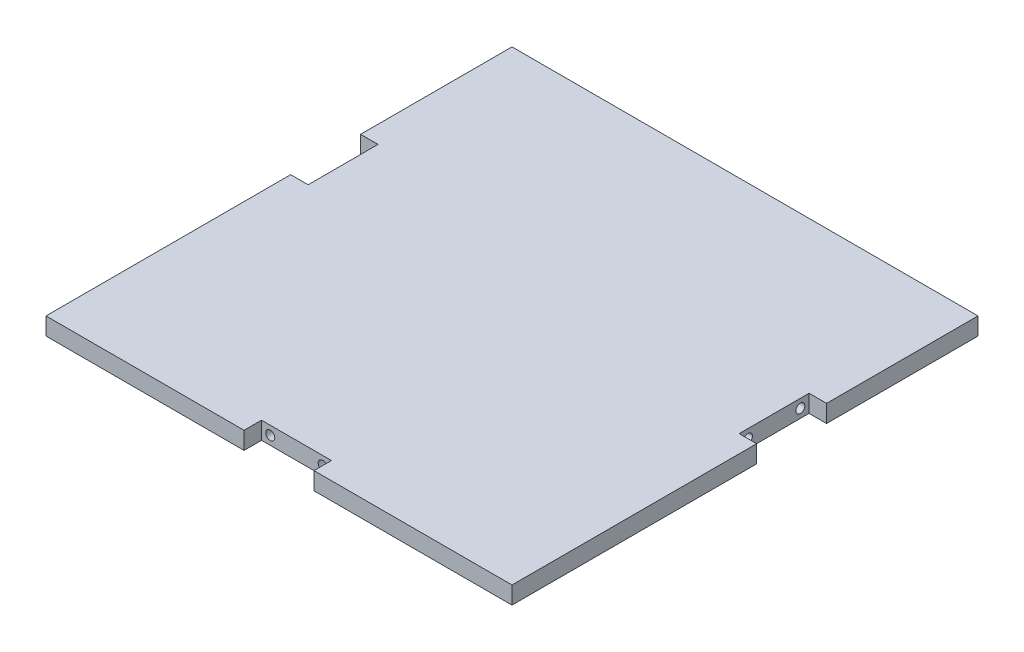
ISO-10303-21;
HEADER;
FILE_DESCRIPTION(('STEP AP214'),'2;1');
FILE_NAME('part.step','',(''),(''),'','','');
FILE_SCHEMA(('AUTOMOTIVE_DESIGN { 1 0 10303 214 1 1 1 1 }'));
ENDSEC;
DATA;
#1=APPLICATION_CONTEXT('core data for automotive mechanical design processes');
#2=APPLICATION_PROTOCOL_DEFINITION('international standard','automotive_design',2000,#1);
#3=PRODUCT_CONTEXT('',#1,'mechanical');
#4=PRODUCT('Part','Part','',(#3));
#5=PRODUCT_RELATED_PRODUCT_CATEGORY('part','',(#4));
#6=PRODUCT_DEFINITION_FORMATION('','',#4);
#7=PRODUCT_DEFINITION_CONTEXT('part definition',#1,'design');
#8=PRODUCT_DEFINITION('design','',#6,#7);
#9=PRODUCT_DEFINITION_SHAPE('','',#8);
#10=(LENGTH_UNIT() NAMED_UNIT(*) SI_UNIT(.MILLI.,.METRE.));
#11=(NAMED_UNIT(*) PLANE_ANGLE_UNIT() SI_UNIT($,.RADIAN.));
#12=(NAMED_UNIT(*) SI_UNIT($,.STERADIAN.) SOLID_ANGLE_UNIT());
#13=UNCERTAINTY_MEASURE_WITH_UNIT(LENGTH_MEASURE(1.E-05),#10,'distance_accuracy_value','');
#14=(GEOMETRIC_REPRESENTATION_CONTEXT(3) GLOBAL_UNCERTAINTY_ASSIGNED_CONTEXT((#13)) GLOBAL_UNIT_ASSIGNED_CONTEXT((#10,
#11,#12)) REPRESENTATION_CONTEXT('',''));
#15=CARTESIAN_POINT('',(0.,0.,0.));
#16=DIRECTION('',(0.,0.,1.));
#17=DIRECTION('',(1.,0.,0.));
#18=AXIS2_PLACEMENT_3D('',#15,#16,#17);
#19=CARTESIAN_POINT('',(-127.,9.525,127.));
#20=DIRECTION('',(0.,0.,-1.));
#21=DIRECTION('',(-1.,0.,0.));
#22=AXIS2_PLACEMENT_3D('',#19,#20,#21);
#23=PLANE('',#22);
#24=DIRECTION('',(1.,0.,0.));
#25=VECTOR('',#24,1.);
#26=CARTESIAN_POINT('',(-127.,0.,127.));
#27=LINE('',#26,#25);
#28=CARTESIAN_POINT('',(-127.,0.,127.));
#29=VERTEX_POINT('',#28);
#30=CARTESIAN_POINT('',(-19.05,0.,127.));
#31=VERTEX_POINT('',#30);
#32=EDGE_CURVE('E307',#29,#31,#27,.T.);
#33=ORIENTED_EDGE('',*,*,#32,.T.);
#34=DIRECTION('',(0.,1.,0.));
#35=VECTOR('',#34,1.);
#36=CARTESIAN_POINT('',(-19.05,0.,127.));
#37=LINE('',#36,#35);
#38=CARTESIAN_POINT('',(-19.05,9.525,127.));
#39=VERTEX_POINT('',#38);
#40=EDGE_CURVE('E216',#31,#39,#37,.T.);
#41=ORIENTED_EDGE('',*,*,#40,.T.);
#42=DIRECTION('',(1.,0.,0.));
#43=VECTOR('',#42,1.);
#44=CARTESIAN_POINT('',(-127.,9.525,127.));
#45=LINE('',#44,#43);
#46=CARTESIAN_POINT('',(-127.,9.525,127.));
#47=VERTEX_POINT('',#46);
#48=EDGE_CURVE('E293',#47,#39,#45,.T.);
#49=ORIENTED_EDGE('',*,*,#48,.F.);
#50=DIRECTION('',(0.,-1.,0.));
#51=VECTOR('',#50,1.);
#52=CARTESIAN_POINT('',(-127.,9.525,127.));
#53=LINE('',#52,#51);
#54=EDGE_CURVE('E312',#47,#29,#53,.T.);
#55=ORIENTED_EDGE('',*,*,#54,.T.);
#56=EDGE_LOOP('',(#33,#41,#49,#55));
#57=FACE_BOUND('',#56,.T.);
#58=ADVANCED_FACE('F33',(#57),#23,.F.);
#59=CARTESIAN_POINT('',(127.,9.525,-127.));
#60=DIRECTION('',(-1.,0.,0.));
#61=DIRECTION('',(0.,0.,1.));
#62=AXIS2_PLACEMENT_3D('',#59,#60,#61);
#63=PLANE('',#62);
#64=DIRECTION('',(0.,0.,-1.));
#65=VECTOR('',#64,1.);
#66=CARTESIAN_POINT('',(127.,9.525,-127.));
#67=LINE('',#66,#65);
#68=CARTESIAN_POINT('',(127.,9.525,-44.45));
#69=VERTEX_POINT('',#68);
#70=CARTESIAN_POINT('',(127.,9.525,-127.));
#71=VERTEX_POINT('',#70);
#72=EDGE_CURVE('E286',#69,#71,#67,.T.);
#73=ORIENTED_EDGE('',*,*,#72,.F.);
#74=DIRECTION('',(0.,1.,0.));
#75=VECTOR('',#74,1.);
#76=CARTESIAN_POINT('',(127.,0.,-44.45));
#77=LINE('',#76,#75);
#78=CARTESIAN_POINT('',(127.,0.,-44.45));
#79=VERTEX_POINT('',#78);
#80=EDGE_CURVE('E247',#79,#69,#77,.T.);
#81=ORIENTED_EDGE('',*,*,#80,.F.);
#82=DIRECTION('',(0.,0.,-1.));
#83=VECTOR('',#82,1.);
#84=CARTESIAN_POINT('',(127.,0.,-127.));
#85=LINE('',#84,#83);
#86=CARTESIAN_POINT('',(127.,0.,-127.));
#87=VERTEX_POINT('',#86);
#88=EDGE_CURVE('E276',#79,#87,#85,.T.);
#89=ORIENTED_EDGE('',*,*,#88,.T.);
#90=DIRECTION('',(0.,-1.,0.));
#91=VECTOR('',#90,1.);
#92=CARTESIAN_POINT('',(127.,9.525,-127.));
#93=LINE('',#92,#91);
#94=EDGE_CURVE('E11',#71,#87,#93,.T.);
#95=ORIENTED_EDGE('',*,*,#94,.F.);
#96=EDGE_LOOP('',(#73,#81,#89,#95));
#97=FACE_BOUND('',#96,.T.);
#98=ADVANCED_FACE('F339',(#97),#63,.F.);
#99=CARTESIAN_POINT('',(-127.,9.525,-127.));
#100=DIRECTION('',(1.,0.,0.));
#101=DIRECTION('',(0.,0.,-1.));
#102=AXIS2_PLACEMENT_3D('',#99,#100,#101);
#103=PLANE('',#102);
#104=DIRECTION('',(0.,0.,1.));
#105=VECTOR('',#104,1.);
#106=CARTESIAN_POINT('',(-127.,0.,-127.));
#107=LINE('',#106,#105);
#108=CARTESIAN_POINT('',(-127.,0.,-127.));
#109=VERTEX_POINT('',#108);
#110=CARTESIAN_POINT('',(-127.,0.,-44.45));
#111=VERTEX_POINT('',#110);
#112=EDGE_CURVE('E303',#109,#111,#107,.T.);
#113=ORIENTED_EDGE('',*,*,#112,.T.);
#114=DIRECTION('',(0.,1.,0.));
#115=VECTOR('',#114,1.);
#116=CARTESIAN_POINT('',(-127.,0.,-44.45));
#117=LINE('',#116,#115);
#118=CARTESIAN_POINT('',(-127.,9.525,-44.45));
#119=VERTEX_POINT('',#118);
#120=EDGE_CURVE('E273',#111,#119,#117,.T.);
#121=ORIENTED_EDGE('',*,*,#120,.T.);
#122=DIRECTION('',(0.,0.,1.));
#123=VECTOR('',#122,1.);
#124=CARTESIAN_POINT('',(-127.,9.525,-127.));
#125=LINE('',#124,#123);
#126=CARTESIAN_POINT('',(-127.,9.525,-127.));
#127=VERTEX_POINT('',#126);
#128=EDGE_CURVE('E289',#127,#119,#125,.T.);
#129=ORIENTED_EDGE('',*,*,#128,.F.);
#130=DIRECTION('',(0.,-1.,0.));
#131=VECTOR('',#130,1.);
#132=CARTESIAN_POINT('',(-127.,9.525,-127.));
#133=LINE('',#132,#131);
#134=EDGE_CURVE('E41',#127,#109,#133,.T.);
#135=ORIENTED_EDGE('',*,*,#134,.T.);
#136=EDGE_LOOP('',(#113,#121,#129,#135));
#137=FACE_BOUND('',#136,.T.);
#138=ADVANCED_FACE('F319',(#137),#103,.F.);
#139=CARTESIAN_POINT('',(127.,0.,127.));
#140=VERTEX_POINT('',#139);
#141=CARTESIAN_POINT('',(127.,0.,-6.34999999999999));
#142=VERTEX_POINT('',#141);
#143=EDGE_CURVE('E297',#140,#142,#85,.T.);
#144=ORIENTED_EDGE('',*,*,#143,.T.);
#145=DIRECTION('',(0.,1.,0.));
#146=VECTOR('',#145,1.);
#147=CARTESIAN_POINT('',(127.,0.,-6.34999999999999));
#148=LINE('',#147,#146);
#149=CARTESIAN_POINT('',(127.,9.525,-6.34999999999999));
#150=VERTEX_POINT('',#149);
#151=EDGE_CURVE('E250',#142,#150,#148,.T.);
#152=ORIENTED_EDGE('',*,*,#151,.T.);
#153=CARTESIAN_POINT('',(127.,9.525,127.));
#154=VERTEX_POINT('',#153);
#155=EDGE_CURVE('E282',#154,#150,#67,.T.);
#156=ORIENTED_EDGE('',*,*,#155,.F.);
#157=DIRECTION('',(0.,-1.,0.));
#158=VECTOR('',#157,1.);
#159=CARTESIAN_POINT('',(127.,9.525,127.));
#160=LINE('',#159,#158);
#161=EDGE_CURVE('E296',#154,#140,#160,.T.);
#162=ORIENTED_EDGE('',*,*,#161,.T.);
#163=EDGE_LOOP('',(#144,#152,#156,#162));
#164=FACE_BOUND('',#163,.T.);
#165=ADVANCED_FACE('F35',(#164),#63,.F.);
#166=CARTESIAN_POINT('',(-127.,9.525,-127.));
#167=DIRECTION('',(0.,0.,1.));
#168=DIRECTION('',(1.,0.,0.));
#169=AXIS2_PLACEMENT_3D('',#166,#167,#168);
#170=PLANE('',#169);
#171=DIRECTION('',(-1.,0.,0.));
#172=VECTOR('',#171,1.);
#173=CARTESIAN_POINT('',(-127.,0.,-127.));
#174=LINE('',#173,#172);
#175=EDGE_CURVE('E300',#87,#109,#174,.T.);
#176=ORIENTED_EDGE('',*,*,#175,.T.);
#177=ORIENTED_EDGE('',*,*,#134,.F.);
#178=DIRECTION('',(-1.,0.,0.));
#179=VECTOR('',#178,1.);
#180=CARTESIAN_POINT('',(-127.,9.525,-127.));
#181=LINE('',#180,#179);
#182=EDGE_CURVE('E285',#71,#127,#181,.T.);
#183=ORIENTED_EDGE('',*,*,#182,.F.);
#184=ORIENTED_EDGE('',*,*,#94,.T.);
#185=EDGE_LOOP('',(#176,#177,#183,#184));
#186=FACE_BOUND('',#185,.T.);
#187=ADVANCED_FACE('F337',(#186),#170,.F.);
#188=CARTESIAN_POINT('',(-127.,9.525,-6.34999999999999));
#189=VERTEX_POINT('',#188);
#190=EDGE_CURVE('E288',#189,#47,#125,.T.);
#191=ORIENTED_EDGE('',*,*,#190,.F.);
#192=DIRECTION('',(0.,1.,0.));
#193=VECTOR('',#192,1.);
#194=CARTESIAN_POINT('',(-127.,0.,-6.34999999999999));
#195=LINE('',#194,#193);
#196=CARTESIAN_POINT('',(-127.,0.,-6.34999999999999));
#197=VERTEX_POINT('',#196);
#198=EDGE_CURVE('E266',#197,#189,#195,.T.);
#199=ORIENTED_EDGE('',*,*,#198,.F.);
#200=EDGE_CURVE('E302',#197,#29,#107,.T.);
#201=ORIENTED_EDGE('',*,*,#200,.T.);
#202=ORIENTED_EDGE('',*,*,#54,.F.);
#203=EDGE_LOOP('',(#191,#199,#201,#202));
#204=FACE_BOUND('',#203,.T.);
#205=ADVANCED_FACE('F374',(#204),#103,.F.);
#206=CARTESIAN_POINT('',(19.05,9.525,127.));
#207=VERTEX_POINT('',#206);
#208=EDGE_CURVE('E292',#207,#154,#45,.T.);
#209=ORIENTED_EDGE('',*,*,#208,.F.);
#210=DIRECTION('',(0.,1.,0.));
#211=VECTOR('',#210,1.);
#212=CARTESIAN_POINT('',(19.05,0.,127.));
#213=LINE('',#212,#211);
#214=CARTESIAN_POINT('',(19.05,0.,127.));
#215=VERTEX_POINT('',#214);
#216=EDGE_CURVE('E228',#215,#207,#213,.T.);
#217=ORIENTED_EDGE('',*,*,#216,.F.);
#218=EDGE_CURVE('E306',#215,#140,#27,.T.);
#219=ORIENTED_EDGE('',*,*,#218,.T.);
#220=ORIENTED_EDGE('',*,*,#161,.F.);
#221=EDGE_LOOP('',(#209,#217,#219,#220));
#222=FACE_BOUND('',#221,.T.);
#223=ADVANCED_FACE('F358',(#222),#23,.F.);
#224=CARTESIAN_POINT('',(0.,9.525,0.));
#225=DIRECTION('',(0.,1.,0.));
#226=DIRECTION('',(0.,0.,1.));
#227=AXIS2_PLACEMENT_3D('',#224,#225,#226);
#228=PLANE('',#227);
#229=DIRECTION('',(0.,0.,1.));
#230=VECTOR('',#229,1.);
#231=CARTESIAN_POINT('',(-19.05,9.525,127.));
#232=LINE('',#231,#230);
#233=CARTESIAN_POINT('',(-19.05,9.525,117.475));
#234=VERTEX_POINT('',#233);
#235=EDGE_CURVE('E207',#234,#39,#232,.T.);
#236=ORIENTED_EDGE('',*,*,#235,.F.);
#237=DIRECTION('',(-1.,0.,0.));
#238=VECTOR('',#237,1.);
#239=CARTESIAN_POINT('',(-19.05,9.525,117.475));
#240=LINE('',#239,#238);
#241=CARTESIAN_POINT('',(19.05,9.525,117.475));
#242=VERTEX_POINT('',#241);
#243=EDGE_CURVE('E212',#242,#234,#240,.T.);
#244=ORIENTED_EDGE('',*,*,#243,.F.);
#245=DIRECTION('',(0.,0.,-1.));
#246=VECTOR('',#245,1.);
#247=CARTESIAN_POINT('',(19.05,9.525,127.));
#248=LINE('',#247,#246);
#249=EDGE_CURVE('E218',#207,#242,#248,.T.);
#250=ORIENTED_EDGE('',*,*,#249,.F.);
#251=ORIENTED_EDGE('',*,*,#208,.T.);
#252=ORIENTED_EDGE('',*,*,#155,.T.);
#253=DIRECTION('',(1.,0.,0.));
#254=VECTOR('',#253,1.);
#255=CARTESIAN_POINT('',(127.,9.525,-6.34999999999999));
#256=LINE('',#255,#254);
#257=CARTESIAN_POINT('',(117.475,9.525,-6.34999999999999));
#258=VERTEX_POINT('',#257);
#259=EDGE_CURVE('E236',#258,#150,#256,.T.);
#260=ORIENTED_EDGE('',*,*,#259,.F.);
#261=DIRECTION('',(0.,0.,1.));
#262=VECTOR('',#261,1.);
#263=CARTESIAN_POINT('',(117.475,9.525,-44.45));
#264=LINE('',#263,#262);
#265=CARTESIAN_POINT('',(117.475,9.525,-44.45));
#266=VERTEX_POINT('',#265);
#267=EDGE_CURVE('E243',#266,#258,#264,.T.);
#268=ORIENTED_EDGE('',*,*,#267,.F.);
#269=DIRECTION('',(-1.,0.,0.));
#270=VECTOR('',#269,1.);
#271=CARTESIAN_POINT('',(127.,9.525,-44.45));
#272=LINE('',#271,#270);
#273=EDGE_CURVE('E225',#69,#266,#272,.T.);
#274=ORIENTED_EDGE('',*,*,#273,.F.);
#275=ORIENTED_EDGE('',*,*,#72,.T.);
#276=ORIENTED_EDGE('',*,*,#182,.T.);
#277=ORIENTED_EDGE('',*,*,#128,.T.);
#278=DIRECTION('',(-1.,0.,0.));
#279=VECTOR('',#278,1.);
#280=CARTESIAN_POINT('',(-127.,9.525,-44.45));
#281=LINE('',#280,#279);
#282=CARTESIAN_POINT('',(-117.475,9.525,-44.45));
#283=VERTEX_POINT('',#282);
#284=EDGE_CURVE('E260',#283,#119,#281,.T.);
#285=ORIENTED_EDGE('',*,*,#284,.F.);
#286=DIRECTION('',(0.,0.,-1.));
#287=VECTOR('',#286,1.);
#288=CARTESIAN_POINT('',(-117.475,9.525,-44.45));
#289=LINE('',#288,#287);
#290=CARTESIAN_POINT('',(-117.475,9.525,-6.34999999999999));
#291=VERTEX_POINT('',#290);
#292=EDGE_CURVE('E269',#291,#283,#289,.T.);
#293=ORIENTED_EDGE('',*,*,#292,.F.);
#294=DIRECTION('',(1.,0.,0.));
#295=VECTOR('',#294,1.);
#296=CARTESIAN_POINT('',(-127.,9.525,-6.34999999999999));
#297=LINE('',#296,#295);
#298=EDGE_CURVE('E249',#189,#291,#297,.T.);
#299=ORIENTED_EDGE('',*,*,#298,.F.);
#300=ORIENTED_EDGE('',*,*,#190,.T.);
#301=ORIENTED_EDGE('',*,*,#48,.T.);
#302=EDGE_LOOP('',(#236,#244,#250,#251,#252,#260,#268,#274,#275,#276,#277,#285,#293,#299,#300,#301));
#303=FACE_BOUND('',#302,.T.);
#304=ADVANCED_FACE('F332',(#303),#228,.T.);
#305=CARTESIAN_POINT('',(0.,0.,0.));
#306=DIRECTION('',(0.,1.,0.));
#307=DIRECTION('',(0.,0.,1.));
#308=AXIS2_PLACEMENT_3D('',#305,#306,#307);
#309=PLANE('',#308);
#310=DIRECTION('',(-1.,0.,0.));
#311=VECTOR('',#310,1.);
#312=CARTESIAN_POINT('',(-19.05,0.,117.475));
#313=LINE('',#312,#311);
#314=CARTESIAN_POINT('',(19.05,0.,117.475));
#315=VERTEX_POINT('',#314);
#316=CARTESIAN_POINT('',(-19.05,0.,117.475));
#317=VERTEX_POINT('',#316);
#318=EDGE_CURVE('E48',#315,#317,#313,.T.);
#319=ORIENTED_EDGE('',*,*,#318,.T.);
#320=DIRECTION('',(0.,0.,1.));
#321=VECTOR('',#320,1.);
#322=CARTESIAN_POINT('',(-19.05,0.,127.));
#323=LINE('',#322,#321);
#324=EDGE_CURVE('E208',#317,#31,#323,.T.);
#325=ORIENTED_EDGE('',*,*,#324,.T.);
#326=ORIENTED_EDGE('',*,*,#32,.F.);
#327=ORIENTED_EDGE('',*,*,#200,.F.);
#328=DIRECTION('',(1.,0.,0.));
#329=VECTOR('',#328,1.);
#330=CARTESIAN_POINT('',(-127.,0.,-6.34999999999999));
#331=LINE('',#330,#329);
#332=CARTESIAN_POINT('',(-117.475,0.,-6.34999999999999));
#333=VERTEX_POINT('',#332);
#334=EDGE_CURVE('E256',#197,#333,#331,.T.);
#335=ORIENTED_EDGE('',*,*,#334,.T.);
#336=DIRECTION('',(0.,0.,-1.));
#337=VECTOR('',#336,1.);
#338=CARTESIAN_POINT('',(-117.475,0.,-44.45));
#339=LINE('',#338,#337);
#340=CARTESIAN_POINT('',(-117.475,0.,-44.45));
#341=VERTEX_POINT('',#340);
#342=EDGE_CURVE('E259',#333,#341,#339,.T.);
#343=ORIENTED_EDGE('',*,*,#342,.T.);
#344=DIRECTION('',(-1.,0.,0.));
#345=VECTOR('',#344,1.);
#346=CARTESIAN_POINT('',(-127.,0.,-44.45));
#347=LINE('',#346,#345);
#348=EDGE_CURVE('E263',#341,#111,#347,.T.);
#349=ORIENTED_EDGE('',*,*,#348,.T.);
#350=ORIENTED_EDGE('',*,*,#112,.F.);
#351=ORIENTED_EDGE('',*,*,#175,.F.);
#352=ORIENTED_EDGE('',*,*,#88,.F.);
#353=DIRECTION('',(-1.,0.,0.));
#354=VECTOR('',#353,1.);
#355=CARTESIAN_POINT('',(127.,0.,-44.45));
#356=LINE('',#355,#354);
#357=CARTESIAN_POINT('',(117.475,0.,-44.45));
#358=VERTEX_POINT('',#357);
#359=EDGE_CURVE('E232',#79,#358,#356,.T.);
#360=ORIENTED_EDGE('',*,*,#359,.T.);
#361=DIRECTION('',(0.,0.,1.));
#362=VECTOR('',#361,1.);
#363=CARTESIAN_POINT('',(117.475,0.,-44.45));
#364=LINE('',#363,#362);
#365=CARTESIAN_POINT('',(117.475,0.,-6.34999999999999));
#366=VERTEX_POINT('',#365);
#367=EDGE_CURVE('E235',#358,#366,#364,.T.);
#368=ORIENTED_EDGE('',*,*,#367,.T.);
#369=DIRECTION('',(1.,0.,0.));
#370=VECTOR('',#369,1.);
#371=CARTESIAN_POINT('',(127.,0.,-6.34999999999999));
#372=LINE('',#371,#370);
#373=EDGE_CURVE('E56',#366,#142,#372,.T.);
#374=ORIENTED_EDGE('',*,*,#373,.T.);
#375=ORIENTED_EDGE('',*,*,#143,.F.);
#376=ORIENTED_EDGE('',*,*,#218,.F.);
#377=DIRECTION('',(0.,0.,-1.));
#378=VECTOR('',#377,1.);
#379=CARTESIAN_POINT('',(19.05,0.,127.));
#380=LINE('',#379,#378);
#381=EDGE_CURVE('E211',#215,#315,#380,.T.);
#382=ORIENTED_EDGE('',*,*,#381,.T.);
#383=EDGE_LOOP('',(#319,#325,#326,#327,#335,#343,#349,#350,#351,#352,#360,#368,#374,#375,#376,#382));
#384=FACE_BOUND('',#383,.T.);
#385=ADVANCED_FACE('F324',(#384),#309,.F.);
#386=CARTESIAN_POINT('',(-127.,0.,-44.45));
#387=DIRECTION('',(0.,0.,-1.));
#388=DIRECTION('',(-1.,0.,0.));
#389=AXIS2_PLACEMENT_3D('',#386,#387,#388);
#390=PLANE('',#389);
#391=ORIENTED_EDGE('',*,*,#284,.T.);
#392=ORIENTED_EDGE('',*,*,#120,.F.);
#393=ORIENTED_EDGE('',*,*,#348,.F.);
#394=DIRECTION('',(0.,1.,0.));
#395=VECTOR('',#394,1.);
#396=CARTESIAN_POINT('',(-117.475,0.,-44.45));
#397=LINE('',#396,#395);
#398=EDGE_CURVE('E277',#341,#283,#397,.T.);
#399=ORIENTED_EDGE('',*,*,#398,.T.);
#400=EDGE_LOOP('',(#391,#392,#393,#399));
#401=FACE_BOUND('',#400,.T.);
#402=ADVANCED_FACE('F328',(#401),#390,.F.);
#403=CARTESIAN_POINT('',(-117.475,0.,-44.45));
#404=DIRECTION('',(1.,0.,0.));
#405=DIRECTION('',(0.,0.,-1.));
#406=AXIS2_PLACEMENT_3D('',#403,#404,#405);
#407=PLANE('',#406);
#408=CARTESIAN_POINT('',(-117.475,4.7625,-39.6875));
#409=DIRECTION('',(-1.,0.,0.));
#410=DIRECTION('',(0.,0.,1.));
#411=AXIS2_PLACEMENT_3D('',#408,#409,#410);
#412=CIRCLE('',#411,2.45744999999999);
#413=CARTESIAN_POINT('',(-117.475,4.7625,-37.23005));
#414=VERTEX_POINT('',#413);
#415=EDGE_CURVE('E173',#414,#414,#412,.T.);
#416=ORIENTED_EDGE('',*,*,#415,.F.);
#417=EDGE_LOOP('',(#416));
#418=FACE_BOUND('',#417,.T.);
#419=CARTESIAN_POINT('',(-117.475,4.7625,-11.1125));
#420=DIRECTION('',(-1.,0.,0.));
#421=DIRECTION('',(0.,0.,1.));
#422=AXIS2_PLACEMENT_3D('',#419,#420,#421);
#423=CIRCLE('',#422,2.45744999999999);
#424=CARTESIAN_POINT('',(-117.475,4.7625,-8.65505));
#425=VERTEX_POINT('',#424);
#426=EDGE_CURVE('E172',#425,#425,#423,.T.);
#427=ORIENTED_EDGE('',*,*,#426,.F.);
#428=EDGE_LOOP('',(#427));
#429=FACE_BOUND('',#428,.T.);
#430=ORIENTED_EDGE('',*,*,#292,.T.);
#431=ORIENTED_EDGE('',*,*,#398,.F.);
#432=ORIENTED_EDGE('',*,*,#342,.F.);
#433=DIRECTION('',(0.,1.,0.));
#434=VECTOR('',#433,1.);
#435=CARTESIAN_POINT('',(-117.475,0.,-6.34999999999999));
#436=LINE('',#435,#434);
#437=EDGE_CURVE('E279',#333,#291,#436,.T.);
#438=ORIENTED_EDGE('',*,*,#437,.T.);
#439=EDGE_LOOP('',(#430,#431,#432,#438));
#440=FACE_BOUND('',#439,.T.);
#441=ADVANCED_FACE('F380',(#418,#429,#440),#407,.F.);
#442=CARTESIAN_POINT('',(-127.,0.,-6.34999999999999));
#443=DIRECTION('',(0.,0.,1.));
#444=DIRECTION('',(1.,0.,0.));
#445=AXIS2_PLACEMENT_3D('',#442,#443,#444);
#446=PLANE('',#445);
#447=ORIENTED_EDGE('',*,*,#298,.T.);
#448=ORIENTED_EDGE('',*,*,#437,.F.);
#449=ORIENTED_EDGE('',*,*,#334,.F.);
#450=ORIENTED_EDGE('',*,*,#198,.T.);
#451=EDGE_LOOP('',(#447,#448,#449,#450));
#452=FACE_BOUND('',#451,.T.);
#453=ADVANCED_FACE('F377',(#452),#446,.F.);
#454=CARTESIAN_POINT('',(127.,0.,-44.45));
#455=DIRECTION('',(0.,0.,-1.));
#456=DIRECTION('',(-1.,0.,0.));
#457=AXIS2_PLACEMENT_3D('',#454,#455,#456);
#458=PLANE('',#457);
#459=ORIENTED_EDGE('',*,*,#273,.T.);
#460=DIRECTION('',(0.,1.,0.));
#461=VECTOR('',#460,1.);
#462=CARTESIAN_POINT('',(117.475,0.,-44.45));
#463=LINE('',#462,#461);
#464=EDGE_CURVE('E240',#358,#266,#463,.T.);
#465=ORIENTED_EDGE('',*,*,#464,.F.);
#466=ORIENTED_EDGE('',*,*,#359,.F.);
#467=ORIENTED_EDGE('',*,*,#80,.T.);
#468=EDGE_LOOP('',(#459,#465,#466,#467));
#469=FACE_BOUND('',#468,.T.);
#470=ADVANCED_FACE('F343',(#469),#458,.F.);
#471=CARTESIAN_POINT('',(127.,0.,-6.34999999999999));
#472=DIRECTION('',(0.,0.,1.));
#473=DIRECTION('',(1.,0.,0.));
#474=AXIS2_PLACEMENT_3D('',#471,#472,#473);
#475=PLANE('',#474);
#476=ORIENTED_EDGE('',*,*,#259,.T.);
#477=ORIENTED_EDGE('',*,*,#151,.F.);
#478=ORIENTED_EDGE('',*,*,#373,.F.);
#479=DIRECTION('',(0.,1.,0.));
#480=VECTOR('',#479,1.);
#481=CARTESIAN_POINT('',(117.475,0.,-6.34999999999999));
#482=LINE('',#481,#480);
#483=EDGE_CURVE('E253',#366,#258,#482,.T.);
#484=ORIENTED_EDGE('',*,*,#483,.T.);
#485=EDGE_LOOP('',(#476,#477,#478,#484));
#486=FACE_BOUND('',#485,.T.);
#487=ADVANCED_FACE('F348',(#486),#475,.F.);
#488=CARTESIAN_POINT('',(117.475,0.,-44.45));
#489=DIRECTION('',(-1.,0.,0.));
#490=DIRECTION('',(0.,0.,1.));
#491=AXIS2_PLACEMENT_3D('',#488,#489,#490);
#492=PLANE('',#491);
#493=CARTESIAN_POINT('',(117.475,4.7625,-11.1125));
#494=DIRECTION('',(1.,0.,0.));
#495=DIRECTION('',(0.,0.,-1.));
#496=AXIS2_PLACEMENT_3D('',#493,#494,#495);
#497=CIRCLE('',#496,2.45744999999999);
#498=CARTESIAN_POINT('',(117.475,4.7625,-13.56995));
#499=VERTEX_POINT('',#498);
#500=EDGE_CURVE('E195',#499,#499,#497,.T.);
#501=ORIENTED_EDGE('',*,*,#500,.F.);
#502=EDGE_LOOP('',(#501));
#503=FACE_BOUND('',#502,.T.);
#504=CARTESIAN_POINT('',(117.475,4.7625,-39.6875));
#505=DIRECTION('',(1.,0.,0.));
#506=DIRECTION('',(0.,0.,-1.));
#507=AXIS2_PLACEMENT_3D('',#504,#505,#506);
#508=CIRCLE('',#507,2.45744999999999);
#509=CARTESIAN_POINT('',(117.475,4.7625,-42.14495));
#510=VERTEX_POINT('',#509);
#511=EDGE_CURVE('E201',#510,#510,#508,.T.);
#512=ORIENTED_EDGE('',*,*,#511,.F.);
#513=EDGE_LOOP('',(#512));
#514=FACE_BOUND('',#513,.T.);
#515=ORIENTED_EDGE('',*,*,#267,.T.);
#516=ORIENTED_EDGE('',*,*,#483,.F.);
#517=ORIENTED_EDGE('',*,*,#367,.F.);
#518=ORIENTED_EDGE('',*,*,#464,.T.);
#519=EDGE_LOOP('',(#515,#516,#517,#518));
#520=FACE_BOUND('',#519,.T.);
#521=ADVANCED_FACE('F346',(#503,#514,#520),#492,.F.);
#522=CARTESIAN_POINT('',(-19.05,0.,127.));
#523=DIRECTION('',(-1.,0.,0.));
#524=DIRECTION('',(0.,0.,1.));
#525=AXIS2_PLACEMENT_3D('',#522,#523,#524);
#526=PLANE('',#525);
#527=ORIENTED_EDGE('',*,*,#235,.T.);
#528=ORIENTED_EDGE('',*,*,#40,.F.);
#529=ORIENTED_EDGE('',*,*,#324,.F.);
#530=DIRECTION('',(0.,1.,0.));
#531=VECTOR('',#530,1.);
#532=CARTESIAN_POINT('',(-19.05,0.,117.475));
#533=LINE('',#532,#531);
#534=EDGE_CURVE('E223',#317,#234,#533,.T.);
#535=ORIENTED_EDGE('',*,*,#534,.T.);
#536=EDGE_LOOP('',(#527,#528,#529,#535));
#537=FACE_BOUND('',#536,.T.);
#538=ADVANCED_FACE('F366',(#537),#526,.F.);
#539=CARTESIAN_POINT('',(-19.05,0.,117.475));
#540=DIRECTION('',(0.,0.,-1.));
#541=DIRECTION('',(-1.,0.,0.));
#542=AXIS2_PLACEMENT_3D('',#539,#540,#541);
#543=PLANE('',#542);
#544=CARTESIAN_POINT('',(-14.2875,4.7625,117.475));
#545=DIRECTION('',(0.,0.,1.));
#546=DIRECTION('',(1.,0.,0.));
#547=AXIS2_PLACEMENT_3D('',#544,#545,#546);
#548=CIRCLE('',#547,2.45744999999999);
#549=CARTESIAN_POINT('',(-11.83005,4.7625,117.475));
#550=VERTEX_POINT('',#549);
#551=EDGE_CURVE('E183',#550,#550,#548,.T.);
#552=ORIENTED_EDGE('',*,*,#551,.F.);
#553=EDGE_LOOP('',(#552));
#554=FACE_BOUND('',#553,.T.);
#555=CARTESIAN_POINT('',(14.2875,4.7625,117.475));
#556=DIRECTION('',(0.,0.,1.));
#557=DIRECTION('',(1.,0.,0.));
#558=AXIS2_PLACEMENT_3D('',#555,#556,#557);
#559=CIRCLE('',#558,2.45744999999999);
#560=CARTESIAN_POINT('',(16.74495,4.7625,117.475));
#561=VERTEX_POINT('',#560);
#562=EDGE_CURVE('E189',#561,#561,#559,.T.);
#563=ORIENTED_EDGE('',*,*,#562,.F.);
#564=EDGE_LOOP('',(#563));
#565=FACE_BOUND('',#564,.T.);
#566=ORIENTED_EDGE('',*,*,#243,.T.);
#567=ORIENTED_EDGE('',*,*,#534,.F.);
#568=ORIENTED_EDGE('',*,*,#318,.F.);
#569=DIRECTION('',(0.,1.,0.));
#570=VECTOR('',#569,1.);
#571=CARTESIAN_POINT('',(19.05,0.,117.475));
#572=LINE('',#571,#570);
#573=EDGE_CURVE('E226',#315,#242,#572,.T.);
#574=ORIENTED_EDGE('',*,*,#573,.T.);
#575=EDGE_LOOP('',(#566,#567,#568,#574));
#576=FACE_BOUND('',#575,.T.);
#577=ADVANCED_FACE('F362',(#554,#565,#576),#543,.F.);
#578=CARTESIAN_POINT('',(19.05,0.,127.));
#579=DIRECTION('',(1.,0.,0.));
#580=DIRECTION('',(0.,0.,-1.));
#581=AXIS2_PLACEMENT_3D('',#578,#579,#580);
#582=PLANE('',#581);
#583=ORIENTED_EDGE('',*,*,#249,.T.);
#584=ORIENTED_EDGE('',*,*,#573,.F.);
#585=ORIENTED_EDGE('',*,*,#381,.F.);
#586=ORIENTED_EDGE('',*,*,#216,.T.);
#587=EDGE_LOOP('',(#583,#584,#585,#586));
#588=FACE_BOUND('',#587,.T.);
#589=ADVANCED_FACE('F361',(#588),#582,.F.);
#590=CARTESIAN_POINT('',(104.775,4.7625,-39.6875));
#591=DIRECTION('',(1.,0.,0.));
#592=DIRECTION('',(0.,0.,-1.));
#593=AXIS2_PLACEMENT_3D('',#590,#591,#592);
#594=CONICAL_SURFACE('',#593,2.45745,1.02974425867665);
#595=CARTESIAN_POINT('',(103.298415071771,4.76249999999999,-39.6875));
#596=VERTEX_POINT('',#595);
#597=VERTEX_LOOP('',#596);
#598=FACE_BOUND('',#597,.T.);
#599=CARTESIAN_POINT('',(104.775,4.7625,-39.6875));
#600=DIRECTION('',(1.,0.,0.));
#601=DIRECTION('',(0.,0.,-1.));
#602=AXIS2_PLACEMENT_3D('',#599,#600,#601);
#603=CIRCLE('',#602,2.45745);
#604=CARTESIAN_POINT('',(104.775,4.7625,-42.14495));
#605=VERTEX_POINT('',#604);
#606=EDGE_CURVE('E204',#605,#605,#603,.T.);
#607=ORIENTED_EDGE('',*,*,#606,.T.);
#608=EDGE_LOOP('',(#607));
#609=FACE_BOUND('',#608,.T.);
#610=ADVANCED_FACE('F503',(#598,#609),#594,.F.);
#611=CARTESIAN_POINT('',(117.475,4.7625,-39.6875));
#612=DIRECTION('',(1.,0.,0.));
#613=DIRECTION('',(0.,0.,-1.));
#614=AXIS2_PLACEMENT_3D('',#611,#612,#613);
#615=CYLINDRICAL_SURFACE('',#614,2.45744999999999);
#616=ORIENTED_EDGE('',*,*,#606,.F.);
#617=EDGE_LOOP('',(#616));
#618=FACE_BOUND('',#617,.T.);
#619=ORIENTED_EDGE('',*,*,#511,.T.);
#620=EDGE_LOOP('',(#619));
#621=FACE_BOUND('',#620,.T.);
#622=ADVANCED_FACE('F519',(#618,#621),#615,.F.);
#623=CARTESIAN_POINT('',(104.775,4.7625,-11.1125));
#624=DIRECTION('',(1.,0.,0.));
#625=DIRECTION('',(0.,0.,-1.));
#626=AXIS2_PLACEMENT_3D('',#623,#624,#625);
#627=CONICAL_SURFACE('',#626,2.45745,1.02974425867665);
#628=CARTESIAN_POINT('',(103.298415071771,4.7625,-11.1125));
#629=VERTEX_POINT('',#628);
#630=VERTEX_LOOP('',#629);
#631=FACE_BOUND('',#630,.T.);
#632=CARTESIAN_POINT('',(104.775,4.7625,-11.1125));
#633=DIRECTION('',(1.,0.,0.));
#634=DIRECTION('',(0.,0.,-1.));
#635=AXIS2_PLACEMENT_3D('',#632,#633,#634);
#636=CIRCLE('',#635,2.45745);
#637=CARTESIAN_POINT('',(104.775,4.7625,-13.56995));
#638=VERTEX_POINT('',#637);
#639=EDGE_CURVE('E198',#638,#638,#636,.T.);
#640=ORIENTED_EDGE('',*,*,#639,.T.);
#641=EDGE_LOOP('',(#640));
#642=FACE_BOUND('',#641,.T.);
#643=ADVANCED_FACE('F529',(#631,#642),#627,.F.);
#644=CARTESIAN_POINT('',(117.475,4.7625,-11.1125));
#645=DIRECTION('',(1.,0.,0.));
#646=DIRECTION('',(0.,0.,-1.));
#647=AXIS2_PLACEMENT_3D('',#644,#645,#646);
#648=CYLINDRICAL_SURFACE('',#647,2.45744999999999);
#649=ORIENTED_EDGE('',*,*,#639,.F.);
#650=EDGE_LOOP('',(#649));
#651=FACE_BOUND('',#650,.T.);
#652=ORIENTED_EDGE('',*,*,#500,.T.);
#653=EDGE_LOOP('',(#652));
#654=FACE_BOUND('',#653,.T.);
#655=ADVANCED_FACE('F539',(#651,#654),#648,.F.);
#656=CARTESIAN_POINT('',(14.2875,4.7625,104.775));
#657=DIRECTION('',(0.,0.,1.));
#658=DIRECTION('',(1.,0.,0.));
#659=AXIS2_PLACEMENT_3D('',#656,#657,#658);
#660=CONICAL_SURFACE('',#659,2.45745,1.02974425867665);
#661=CARTESIAN_POINT('',(14.2875,4.7625,103.298415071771));
#662=VERTEX_POINT('',#661);
#663=VERTEX_LOOP('',#662);
#664=FACE_BOUND('',#663,.T.);
#665=CARTESIAN_POINT('',(14.2875,4.7625,104.775));
#666=DIRECTION('',(0.,0.,1.));
#667=DIRECTION('',(1.,0.,0.));
#668=AXIS2_PLACEMENT_3D('',#665,#666,#667);
#669=CIRCLE('',#668,2.45745);
#670=CARTESIAN_POINT('',(16.74495,4.7625,104.775));
#671=VERTEX_POINT('',#670);
#672=EDGE_CURVE('E192',#671,#671,#669,.T.);
#673=ORIENTED_EDGE('',*,*,#672,.T.);
#674=EDGE_LOOP('',(#673));
#675=FACE_BOUND('',#674,.T.);
#676=ADVANCED_FACE('F549',(#664,#675),#660,.F.);
#677=CARTESIAN_POINT('',(14.2875,4.7625,117.475));
#678=DIRECTION('',(0.,0.,1.));
#679=DIRECTION('',(1.,0.,0.));
#680=AXIS2_PLACEMENT_3D('',#677,#678,#679);
#681=CYLINDRICAL_SURFACE('',#680,2.45744999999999);
#682=ORIENTED_EDGE('',*,*,#672,.F.);
#683=EDGE_LOOP('',(#682));
#684=FACE_BOUND('',#683,.T.);
#685=ORIENTED_EDGE('',*,*,#562,.T.);
#686=EDGE_LOOP('',(#685));
#687=FACE_BOUND('',#686,.T.);
#688=ADVANCED_FACE('F566',(#684,#687),#681,.F.);
#689=CARTESIAN_POINT('',(-14.2875,4.7625,104.775));
#690=DIRECTION('',(0.,0.,1.));
#691=DIRECTION('',(1.,0.,0.));
#692=AXIS2_PLACEMENT_3D('',#689,#690,#691);
#693=CONICAL_SURFACE('',#692,2.45745,1.02974425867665);
#694=CARTESIAN_POINT('',(-14.2875,4.7625,103.298415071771));
#695=VERTEX_POINT('',#694);
#696=VERTEX_LOOP('',#695);
#697=FACE_BOUND('',#696,.T.);
#698=CARTESIAN_POINT('',(-14.2875,4.7625,104.775));
#699=DIRECTION('',(0.,0.,1.));
#700=DIRECTION('',(1.,0.,0.));
#701=AXIS2_PLACEMENT_3D('',#698,#699,#700);
#702=CIRCLE('',#701,2.45745);
#703=CARTESIAN_POINT('',(-11.83005,4.7625,104.775));
#704=VERTEX_POINT('',#703);
#705=EDGE_CURVE('E186',#704,#704,#702,.T.);
#706=ORIENTED_EDGE('',*,*,#705,.T.);
#707=EDGE_LOOP('',(#706));
#708=FACE_BOUND('',#707,.T.);
#709=ADVANCED_FACE('F576',(#697,#708),#693,.F.);
#710=CARTESIAN_POINT('',(-14.2875,4.7625,117.475));
#711=DIRECTION('',(0.,0.,1.));
#712=DIRECTION('',(1.,0.,0.));
#713=AXIS2_PLACEMENT_3D('',#710,#711,#712);
#714=CYLINDRICAL_SURFACE('',#713,2.45744999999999);
#715=ORIENTED_EDGE('',*,*,#705,.F.);
#716=EDGE_LOOP('',(#715));
#717=FACE_BOUND('',#716,.T.);
#718=ORIENTED_EDGE('',*,*,#551,.T.);
#719=EDGE_LOOP('',(#718));
#720=FACE_BOUND('',#719,.T.);
#721=ADVANCED_FACE('F586',(#717,#720),#714,.F.);
#722=CARTESIAN_POINT('',(-104.775,4.7625,-11.1125));
#723=DIRECTION('',(-1.,0.,0.));
#724=DIRECTION('',(0.,0.,1.));
#725=AXIS2_PLACEMENT_3D('',#722,#723,#724);
#726=CONICAL_SURFACE('',#725,2.45744999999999,1.02974425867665);
#727=CARTESIAN_POINT('',(-103.298415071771,4.7625,-11.1125));
#728=VERTEX_POINT('',#727);
#729=VERTEX_LOOP('',#728);
#730=FACE_BOUND('',#729,.T.);
#731=CARTESIAN_POINT('',(-104.775,4.7625,-11.1125));
#732=DIRECTION('',(-1.,0.,0.));
#733=DIRECTION('',(0.,0.,1.));
#734=AXIS2_PLACEMENT_3D('',#731,#732,#733);
#735=CIRCLE('',#734,2.45744999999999);
#736=CARTESIAN_POINT('',(-104.775,4.7625,-8.65505000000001));
#737=VERTEX_POINT('',#736);
#738=EDGE_CURVE('E176',#737,#737,#735,.T.);
#739=ORIENTED_EDGE('',*,*,#738,.T.);
#740=EDGE_LOOP('',(#739));
#741=FACE_BOUND('',#740,.T.);
#742=ADVANCED_FACE('F595',(#730,#741),#726,.F.);
#743=CARTESIAN_POINT('',(-117.475,4.7625,-11.1125));
#744=DIRECTION('',(-1.,0.,0.));
#745=DIRECTION('',(0.,0.,1.));
#746=AXIS2_PLACEMENT_3D('',#743,#744,#745);
#747=CYLINDRICAL_SURFACE('',#746,2.45744999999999);
#748=ORIENTED_EDGE('',*,*,#738,.F.);
#749=EDGE_LOOP('',(#748));
#750=FACE_BOUND('',#749,.T.);
#751=ORIENTED_EDGE('',*,*,#426,.T.);
#752=EDGE_LOOP('',(#751));
#753=FACE_BOUND('',#752,.T.);
#754=ADVANCED_FACE('F166',(#750,#753),#747,.F.);
#755=CARTESIAN_POINT('',(-104.775,4.7625,-39.6875));
#756=DIRECTION('',(-1.,0.,0.));
#757=DIRECTION('',(0.,0.,1.));
#758=AXIS2_PLACEMENT_3D('',#755,#756,#757);
#759=CONICAL_SURFACE('',#758,2.45744999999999,1.02974425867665);
#760=CARTESIAN_POINT('',(-103.298415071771,4.7625,-39.6875));
#761=VERTEX_POINT('',#760);
#762=VERTEX_LOOP('',#761);
#763=FACE_BOUND('',#762,.T.);
#764=CARTESIAN_POINT('',(-104.775,4.7625,-39.6875));
#765=DIRECTION('',(-1.,0.,0.));
#766=DIRECTION('',(0.,0.,1.));
#767=AXIS2_PLACEMENT_3D('',#764,#765,#766);
#768=CIRCLE('',#767,2.45744999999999);
#769=CARTESIAN_POINT('',(-104.775,4.7625,-37.23005));
#770=VERTEX_POINT('',#769);
#771=EDGE_CURVE('E170',#770,#770,#768,.T.);
#772=ORIENTED_EDGE('',*,*,#771,.T.);
#773=EDGE_LOOP('',(#772));
#774=FACE_BOUND('',#773,.T.);
#775=ADVANCED_FACE('F162',(#763,#774),#759,.F.);
#776=CARTESIAN_POINT('',(-117.475,4.7625,-39.6875));
#777=DIRECTION('',(-1.,0.,0.));
#778=DIRECTION('',(0.,0.,1.));
#779=AXIS2_PLACEMENT_3D('',#776,#777,#778);
#780=CYLINDRICAL_SURFACE('',#779,2.45744999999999);
#781=ORIENTED_EDGE('',*,*,#771,.F.);
#782=EDGE_LOOP('',(#781));
#783=FACE_BOUND('',#782,.T.);
#784=ORIENTED_EDGE('',*,*,#415,.T.);
#785=EDGE_LOOP('',(#784));
#786=FACE_BOUND('',#785,.T.);
#787=ADVANCED_FACE('F165',(#783,#786),#780,.F.);
#788=CLOSED_SHELL('',(#58,#98,#138,#165,#187,#205,#223,#304,#385,#402,#441,#453,#470,#487,#521,
#538,#577,#589,#610,#622,#643,#655,#676,#688,#709,#721,#742,#754,#775,#787));
#789=MANIFOLD_SOLID_BREP('B2',#788);
#790=ADVANCED_BREP_SHAPE_REPRESENTATION('',(#18,#789),#14);
#791=SHAPE_DEFINITION_REPRESENTATION(#9,#790);
ENDSEC;
END-ISO-10303-21;
